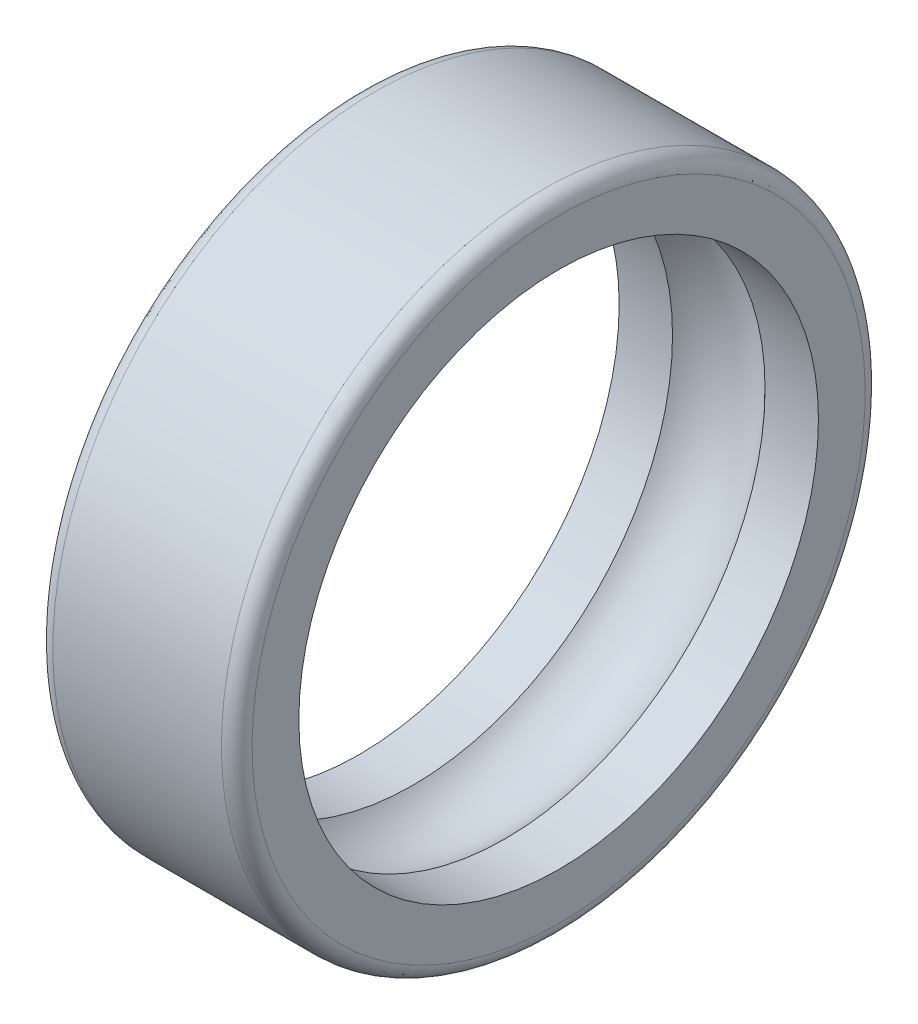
from build123d import *


with BuildPart() as part:
    # Esquisse1 → R_volution1 (revolve)
    with BuildSketch(Plane.XY, mode=Mode.PRIVATE) as r_volution1_sk:
        with BuildLine():
            Line((1, 21), (12, 21))
            ThreePointArc((12, 21), (12.707106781, 20.707106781), (13, 20))
            Line((13, 20), (13, 16.95))
            Line((13, 16.95), (9.51869177, 16.95))
            ThreePointArc((9.51869177, 16.95), (6.5, 18.3), (3.48130823, 16.95))
            Line((3.48130823, 16.95), (0, 16.95))
            Line((0, 16.95), (0, 20))
            ThreePointArc((0, 20), (0.292893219, 20.707106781), (1, 21))
        make_face()
    revolve(r_volution1_sk.sketch.rotate(Axis((0, 0, 0), (1, 0, 0)), 180), axis=Axis((0, 0, 0), (1, 0, 0)))


solid = part.part
